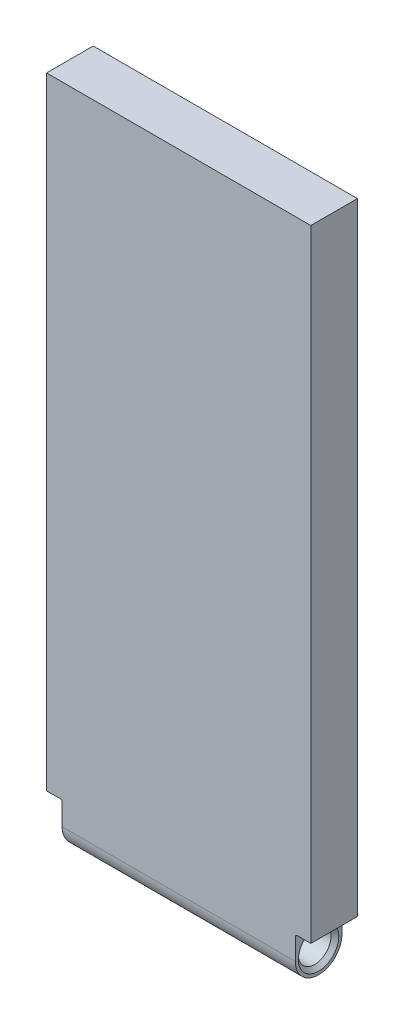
ISO-10303-21;
HEADER;
FILE_DESCRIPTION(('STEP AP214'),'2;1');
FILE_NAME('part.step','',(''),(''),'','','');
FILE_SCHEMA(('AUTOMOTIVE_DESIGN { 1 0 10303 214 1 1 1 1 }'));
ENDSEC;
DATA;
#1=APPLICATION_CONTEXT('core data for automotive mechanical design processes');
#2=APPLICATION_PROTOCOL_DEFINITION('international standard','automotive_design',2000,#1);
#3=PRODUCT_CONTEXT('',#1,'mechanical');
#4=PRODUCT('Part','Part','',(#3));
#5=PRODUCT_RELATED_PRODUCT_CATEGORY('part','',(#4));
#6=PRODUCT_DEFINITION_FORMATION('','',#4);
#7=PRODUCT_DEFINITION_CONTEXT('part definition',#1,'design');
#8=PRODUCT_DEFINITION('design','',#6,#7);
#9=PRODUCT_DEFINITION_SHAPE('','',#8);
#10=(LENGTH_UNIT() NAMED_UNIT(*) SI_UNIT(.MILLI.,.METRE.));
#11=(NAMED_UNIT(*) PLANE_ANGLE_UNIT() SI_UNIT($,.RADIAN.));
#12=(NAMED_UNIT(*) SI_UNIT($,.STERADIAN.) SOLID_ANGLE_UNIT());
#13=UNCERTAINTY_MEASURE_WITH_UNIT(LENGTH_MEASURE(1.E-05),#10,'distance_accuracy_value','');
#14=(GEOMETRIC_REPRESENTATION_CONTEXT(3) GLOBAL_UNCERTAINTY_ASSIGNED_CONTEXT((#13)) GLOBAL_UNIT_ASSIGNED_CONTEXT((#10,
#11,#12)) REPRESENTATION_CONTEXT('',''));
#15=CARTESIAN_POINT('',(0.,0.,0.));
#16=DIRECTION('',(0.,0.,1.));
#17=DIRECTION('',(1.,0.,0.));
#18=AXIS2_PLACEMENT_3D('',#15,#16,#17);
#19=CARTESIAN_POINT('',(-17.,80.,-7.));
#20=DIRECTION('',(0.,1.,0.));
#21=DIRECTION('',(-1.,0.,0.));
#22=AXIS2_PLACEMENT_3D('',#19,#20,#21);
#23=PLANE('',#22);
#24=DIRECTION('',(1.,0.,0.));
#25=VECTOR('',#24,1.);
#26=CARTESIAN_POINT('',(17.,80.,-6.));
#27=LINE('',#26,#25);
#28=CARTESIAN_POINT('',(-17.,80.,-6.));
#29=VERTEX_POINT('',#28);
#30=CARTESIAN_POINT('',(17.,80.,-6.));
#31=VERTEX_POINT('',#30);
#32=EDGE_CURVE('E154',#29,#31,#27,.T.);
#33=ORIENTED_EDGE('',*,*,#32,.F.);
#34=DIRECTION('',(0.,0.,1.));
#35=VECTOR('',#34,1.);
#36=CARTESIAN_POINT('',(-17.,80.,-7.));
#37=LINE('',#36,#35);
#38=CARTESIAN_POINT('',(-17.,80.,0.));
#39=VERTEX_POINT('',#38);
#40=EDGE_CURVE('E187',#29,#39,#37,.T.);
#41=ORIENTED_EDGE('',*,*,#40,.T.);
#42=DIRECTION('',(-1.,0.,0.));
#43=VECTOR('',#42,1.);
#44=CARTESIAN_POINT('',(-17.,80.,0.));
#45=LINE('',#44,#43);
#46=CARTESIAN_POINT('',(17.,80.,0.));
#47=VERTEX_POINT('',#46);
#48=EDGE_CURVE('E200',#47,#39,#45,.T.);
#49=ORIENTED_EDGE('',*,*,#48,.F.);
#50=DIRECTION('',(0.,0.,1.));
#51=VECTOR('',#50,1.);
#52=CARTESIAN_POINT('',(17.,80.,-7.));
#53=LINE('',#52,#51);
#54=EDGE_CURVE('E192',#31,#47,#53,.T.);
#55=ORIENTED_EDGE('',*,*,#54,.F.);
#56=EDGE_LOOP('',(#33,#41,#49,#55));
#57=FACE_BOUND('',#56,.T.);
#58=ADVANCED_FACE('F35',(#57),#23,.T.);
#59=CARTESIAN_POINT('',(-17.,0.,-7.));
#60=DIRECTION('',(0.,-1.,0.));
#61=DIRECTION('',(1.,0.,0.));
#62=AXIS2_PLACEMENT_3D('',#59,#60,#61);
#63=PLANE('',#62);
#64=DIRECTION('',(-1.,0.,0.));
#65=VECTOR('',#64,1.);
#66=CARTESIAN_POINT('',(-15.,0.,-6.));
#67=LINE('',#66,#65);
#68=CARTESIAN_POINT('',(-15.25,0.,-6.));
#69=VERTEX_POINT('',#68);
#70=CARTESIAN_POINT('',(-17.,0.,-6.));
#71=VERTEX_POINT('',#70);
#72=EDGE_CURVE('E131',#69,#71,#67,.T.);
#73=ORIENTED_EDGE('',*,*,#72,.F.);
#74=DIRECTION('',(0.,0.,1.));
#75=VECTOR('',#74,1.);
#76=CARTESIAN_POINT('',(-15.25,0.,-7.));
#77=LINE('',#76,#75);
#78=CARTESIAN_POINT('',(-15.25,0.,0.));
#79=VERTEX_POINT('',#78);
#80=EDGE_CURVE('E182',#69,#79,#77,.T.);
#81=ORIENTED_EDGE('',*,*,#80,.T.);
#82=DIRECTION('',(1.,0.,0.));
#83=VECTOR('',#82,1.);
#84=CARTESIAN_POINT('',(-17.,0.,0.));
#85=LINE('',#84,#83);
#86=CARTESIAN_POINT('',(-17.,0.,0.));
#87=VERTEX_POINT('',#86);
#88=EDGE_CURVE('E168',#87,#79,#85,.T.);
#89=ORIENTED_EDGE('',*,*,#88,.F.);
#90=DIRECTION('',(0.,0.,1.));
#91=VECTOR('',#90,1.);
#92=CARTESIAN_POINT('',(-17.,0.,-7.));
#93=LINE('',#92,#91);
#94=EDGE_CURVE('E172',#71,#87,#93,.T.);
#95=ORIENTED_EDGE('',*,*,#94,.F.);
#96=EDGE_LOOP('',(#73,#81,#89,#95));
#97=FACE_BOUND('',#96,.T.);
#98=ADVANCED_FACE('F220',(#97),#63,.T.);
#99=CARTESIAN_POINT('',(17.,80.,-7.));
#100=DIRECTION('',(1.,0.,0.));
#101=DIRECTION('',(0.,1.,0.));
#102=AXIS2_PLACEMENT_3D('',#99,#100,#101);
#103=PLANE('',#102);
#104=DIRECTION('',(0.,0.,1.));
#105=VECTOR('',#104,1.);
#106=CARTESIAN_POINT('',(17.,0.,-7.));
#107=LINE('',#106,#105);
#108=CARTESIAN_POINT('',(17.,0.,-6.));
#109=VERTEX_POINT('',#108);
#110=CARTESIAN_POINT('',(17.,0.,0.));
#111=VERTEX_POINT('',#110);
#112=EDGE_CURVE('E198',#109,#111,#107,.T.);
#113=ORIENTED_EDGE('',*,*,#112,.F.);
#114=DIRECTION('',(0.,-1.,0.));
#115=VECTOR('',#114,1.);
#116=CARTESIAN_POINT('',(17.,80.,-6.));
#117=LINE('',#116,#115);
#118=EDGE_CURVE('E150',#31,#109,#117,.T.);
#119=ORIENTED_EDGE('',*,*,#118,.F.);
#120=ORIENTED_EDGE('',*,*,#54,.T.);
#121=DIRECTION('',(0.,1.,0.));
#122=VECTOR('',#121,1.);
#123=CARTESIAN_POINT('',(17.,80.,0.));
#124=LINE('',#123,#122);
#125=EDGE_CURVE('E161',#111,#47,#124,.T.);
#126=ORIENTED_EDGE('',*,*,#125,.F.);
#127=EDGE_LOOP('',(#113,#119,#120,#126));
#128=FACE_BOUND('',#127,.T.);
#129=ADVANCED_FACE('F212',(#128),#103,.T.);
#130=CARTESIAN_POINT('',(-17.,80.,-7.));
#131=DIRECTION('',(-1.,0.,0.));
#132=DIRECTION('',(0.,-1.,0.));
#133=AXIS2_PLACEMENT_3D('',#130,#131,#132);
#134=PLANE('',#133);
#135=DIRECTION('',(0.,1.,0.));
#136=VECTOR('',#135,1.);
#137=CARTESIAN_POINT('',(-17.,80.,-6.));
#138=LINE('',#137,#136);
#139=EDGE_CURVE('E147',#71,#29,#138,.T.);
#140=ORIENTED_EDGE('',*,*,#139,.F.);
#141=ORIENTED_EDGE('',*,*,#94,.T.);
#142=DIRECTION('',(0.,-1.,0.));
#143=VECTOR('',#142,1.);
#144=CARTESIAN_POINT('',(-17.,80.,0.));
#145=LINE('',#144,#143);
#146=EDGE_CURVE('E156',#39,#87,#145,.T.);
#147=ORIENTED_EDGE('',*,*,#146,.F.);
#148=ORIENTED_EDGE('',*,*,#40,.F.);
#149=EDGE_LOOP('',(#140,#141,#147,#148));
#150=FACE_BOUND('',#149,.T.);
#151=ADVANCED_FACE('F218',(#150),#134,.T.);
#152=CARTESIAN_POINT('',(15.25,0.,0.));
#153=VERTEX_POINT('',#152);
#154=EDGE_CURVE('E158',#153,#111,#85,.T.);
#155=ORIENTED_EDGE('',*,*,#154,.F.);
#156=DIRECTION('',(0.,0.,1.));
#157=VECTOR('',#156,1.);
#158=CARTESIAN_POINT('',(15.25,0.,-6.));
#159=LINE('',#158,#157);
#160=CARTESIAN_POINT('',(15.25,0.,-6.));
#161=VERTEX_POINT('',#160);
#162=EDGE_CURVE('E57',#153,#161,#159,.F.);
#163=ORIENTED_EDGE('',*,*,#162,.T.);
#164=DIRECTION('',(-1.,0.,0.));
#165=VECTOR('',#164,1.);
#166=CARTESIAN_POINT('',(17.,0.,-6.));
#167=LINE('',#166,#165);
#168=EDGE_CURVE('E152',#109,#161,#167,.T.);
#169=ORIENTED_EDGE('',*,*,#168,.F.);
#170=ORIENTED_EDGE('',*,*,#112,.T.);
#171=EDGE_LOOP('',(#155,#163,#169,#170));
#172=FACE_BOUND('',#171,.T.);
#173=ADVANCED_FACE('F216',(#172),#63,.T.);
#174=CARTESIAN_POINT('',(0.,0.,0.));
#175=DIRECTION('',(0.,0.,1.));
#176=DIRECTION('',(1.,0.,0.));
#177=AXIS2_PLACEMENT_3D('',#174,#175,#176);
#178=PLANE('',#177);
#179=ORIENTED_EDGE('',*,*,#146,.T.);
#180=ORIENTED_EDGE('',*,*,#88,.T.);
#181=CARTESIAN_POINT('',(-15.25,-0.250000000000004,0.));
#182=DIRECTION('',(0.,0.,1.));
#183=DIRECTION('',(1.,0.,0.));
#184=AXIS2_PLACEMENT_3D('',#181,#182,#183);
#185=CIRCLE('',#184,0.25);
#186=CARTESIAN_POINT('',(-15.,-0.250000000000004,0.));
#187=VERTEX_POINT('',#186);
#188=EDGE_CURVE('E181',#79,#187,#185,.F.);
#189=ORIENTED_EDGE('',*,*,#188,.T.);
#190=DIRECTION('',(0.,-1.,0.));
#191=VECTOR('',#190,1.);
#192=CARTESIAN_POINT('',(-15.,0.,0.));
#193=LINE('',#192,#191);
#194=CARTESIAN_POINT('',(-15.,-3.,0.));
#195=VERTEX_POINT('',#194);
#196=EDGE_CURVE('E128',#187,#195,#193,.T.);
#197=ORIENTED_EDGE('',*,*,#196,.T.);
#198=DIRECTION('',(-1.,0.,0.));
#199=VECTOR('',#198,1.);
#200=CARTESIAN_POINT('',(15.,-3.,0.));
#201=LINE('',#200,#199);
#202=CARTESIAN_POINT('',(15.,-3.,0.));
#203=VERTEX_POINT('',#202);
#204=EDGE_CURVE('E124',#203,#195,#201,.T.);
#205=ORIENTED_EDGE('',*,*,#204,.F.);
#206=DIRECTION('',(0.,-1.,0.));
#207=VECTOR('',#206,1.);
#208=CARTESIAN_POINT('',(15.,0.,0.));
#209=LINE('',#208,#207);
#210=CARTESIAN_POINT('',(15.,-0.25,0.));
#211=VERTEX_POINT('',#210);
#212=EDGE_CURVE('E112',#211,#203,#209,.T.);
#213=ORIENTED_EDGE('',*,*,#212,.F.);
#214=CARTESIAN_POINT('',(15.25,-0.25,0.));
#215=DIRECTION('',(0.,0.,1.));
#216=DIRECTION('',(1.,0.,0.));
#217=AXIS2_PLACEMENT_3D('',#214,#215,#216);
#218=CIRCLE('',#217,0.25);
#219=EDGE_CURVE('E50',#211,#153,#218,.F.);
#220=ORIENTED_EDGE('',*,*,#219,.T.);
#221=ORIENTED_EDGE('',*,*,#154,.T.);
#222=ORIENTED_EDGE('',*,*,#125,.T.);
#223=ORIENTED_EDGE('',*,*,#48,.T.);
#224=EDGE_LOOP('',(#179,#180,#189,#197,#205,#213,#220,#221,#222,#223));
#225=FACE_BOUND('',#224,.T.);
#226=ADVANCED_FACE('F126',(#225),#178,.T.);
#227=CARTESIAN_POINT('',(0.,0.,-6.));
#228=DIRECTION('',(0.,0.,-1.));
#229=DIRECTION('',(-1.,0.,0.));
#230=AXIS2_PLACEMENT_3D('',#227,#228,#229);
#231=PLANE('',#230);
#232=ORIENTED_EDGE('',*,*,#118,.T.);
#233=ORIENTED_EDGE('',*,*,#168,.T.);
#234=CARTESIAN_POINT('',(15.25,-0.25,-6.));
#235=DIRECTION('',(0.,0.,-1.));
#236=DIRECTION('',(-1.,0.,0.));
#237=AXIS2_PLACEMENT_3D('',#234,#235,#236);
#238=CIRCLE('',#237,0.25);
#239=CARTESIAN_POINT('',(15.,-0.25,-6.));
#240=VERTEX_POINT('',#239);
#241=EDGE_CURVE('E360',#161,#240,#238,.F.);
#242=ORIENTED_EDGE('',*,*,#241,.T.);
#243=DIRECTION('',(0.,1.,0.));
#244=VECTOR('',#243,1.);
#245=CARTESIAN_POINT('',(15.,0.,-6.));
#246=LINE('',#245,#244);
#247=CARTESIAN_POINT('',(15.,-3.,-6.));
#248=VERTEX_POINT('',#247);
#249=EDGE_CURVE('E137',#248,#240,#246,.T.);
#250=ORIENTED_EDGE('',*,*,#249,.F.);
#251=DIRECTION('',(-1.,0.,0.));
#252=VECTOR('',#251,1.);
#253=CARTESIAN_POINT('',(15.,-3.,-6.));
#254=LINE('',#253,#252);
#255=CARTESIAN_POINT('',(-15.,-3.,-6.));
#256=VERTEX_POINT('',#255);
#257=EDGE_CURVE('E132',#248,#256,#254,.T.);
#258=ORIENTED_EDGE('',*,*,#257,.T.);
#259=DIRECTION('',(0.,1.,0.));
#260=VECTOR('',#259,1.);
#261=CARTESIAN_POINT('',(-15.,0.,-6.));
#262=LINE('',#261,#260);
#263=CARTESIAN_POINT('',(-15.,-0.250000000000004,-6.));
#264=VERTEX_POINT('',#263);
#265=EDGE_CURVE('E121',#256,#264,#262,.T.);
#266=ORIENTED_EDGE('',*,*,#265,.T.);
#267=CARTESIAN_POINT('',(-15.25,-0.250000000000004,-6.));
#268=DIRECTION('',(0.,0.,-1.));
#269=DIRECTION('',(-1.,0.,0.));
#270=AXIS2_PLACEMENT_3D('',#267,#268,#269);
#271=CIRCLE('',#270,0.25);
#272=EDGE_CURVE('E365',#264,#69,#271,.F.);
#273=ORIENTED_EDGE('',*,*,#272,.T.);
#274=ORIENTED_EDGE('',*,*,#72,.T.);
#275=ORIENTED_EDGE('',*,*,#139,.T.);
#276=ORIENTED_EDGE('',*,*,#32,.T.);
#277=EDGE_LOOP('',(#232,#233,#242,#250,#258,#266,#273,#274,#275,#276));
#278=FACE_BOUND('',#277,.T.);
#279=ADVANCED_FACE('F214',(#278),#231,.T.);
#280=CARTESIAN_POINT('',(15.,-3.,-3.));
#281=DIRECTION('',(1.,0.,0.));
#282=DIRECTION('',(0.,0.,-1.));
#283=AXIS2_PLACEMENT_3D('',#280,#281,#282);
#284=PLANE('',#283);
#285=CARTESIAN_POINT('',(15.,-3.,-3.));
#286=DIRECTION('',(1.,0.,0.));
#287=DIRECTION('',(0.,0.,-1.));
#288=AXIS2_PLACEMENT_3D('',#285,#286,#287);
#289=CIRCLE('',#288,2.6);
#290=CARTESIAN_POINT('',(15.,-3.,-5.6));
#291=VERTEX_POINT('',#290);
#292=EDGE_CURVE('E11',#291,#291,#289,.F.);
#293=ORIENTED_EDGE('',*,*,#292,.T.);
#294=EDGE_LOOP('',(#293));
#295=FACE_BOUND('',#294,.T.);
#296=ORIENTED_EDGE('',*,*,#249,.T.);
#297=DIRECTION('',(0.,0.,1.));
#298=VECTOR('',#297,1.);
#299=CARTESIAN_POINT('',(15.,-0.25,0.));
#300=LINE('',#299,#298);
#301=EDGE_CURVE('E120',#240,#211,#300,.T.);
#302=ORIENTED_EDGE('',*,*,#301,.T.);
#303=ORIENTED_EDGE('',*,*,#212,.T.);
#304=CARTESIAN_POINT('',(15.,-3.,-3.));
#305=DIRECTION('',(1.,0.,0.));
#306=DIRECTION('',(0.,0.,-1.));
#307=AXIS2_PLACEMENT_3D('',#304,#305,#306);
#308=CIRCLE('',#307,3.);
#309=EDGE_CURVE('E117',#203,#248,#308,.T.);
#310=ORIENTED_EDGE('',*,*,#309,.T.);
#311=EDGE_LOOP('',(#296,#302,#303,#310));
#312=FACE_BOUND('',#311,.T.);
#313=ADVANCED_FACE('F115',(#295,#312),#284,.T.);
#314=CARTESIAN_POINT('',(-15.,-3.,-3.));
#315=DIRECTION('',(1.,0.,0.));
#316=DIRECTION('',(0.,0.,-1.));
#317=AXIS2_PLACEMENT_3D('',#314,#315,#316);
#318=PLANE('',#317);
#319=CARTESIAN_POINT('',(-15.,-3.,-3.));
#320=DIRECTION('',(1.,0.,0.));
#321=DIRECTION('',(0.,0.,-1.));
#322=AXIS2_PLACEMENT_3D('',#319,#320,#321);
#323=CIRCLE('',#322,2.59999999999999);
#324=CARTESIAN_POINT('',(-15.,-3.,-5.59999999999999));
#325=VERTEX_POINT('',#324);
#326=EDGE_CURVE('E356',#325,#325,#323,.T.);
#327=ORIENTED_EDGE('',*,*,#326,.T.);
#328=EDGE_LOOP('',(#327));
#329=FACE_BOUND('',#328,.T.);
#330=ORIENTED_EDGE('',*,*,#196,.F.);
#331=DIRECTION('',(0.,0.,1.));
#332=VECTOR('',#331,1.);
#333=CARTESIAN_POINT('',(-15.,-0.250000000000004,-3.));
#334=LINE('',#333,#332);
#335=EDGE_CURVE('E179',#187,#264,#334,.F.);
#336=ORIENTED_EDGE('',*,*,#335,.T.);
#337=ORIENTED_EDGE('',*,*,#265,.F.);
#338=CARTESIAN_POINT('',(-15.,-3.,-3.));
#339=DIRECTION('',(1.,0.,0.));
#340=DIRECTION('',(0.,0.,-1.));
#341=AXIS2_PLACEMENT_3D('',#338,#339,#340);
#342=CIRCLE('',#341,3.);
#343=EDGE_CURVE('E141',#195,#256,#342,.T.);
#344=ORIENTED_EDGE('',*,*,#343,.F.);
#345=EDGE_LOOP('',(#330,#336,#337,#344));
#346=FACE_BOUND('',#345,.T.);
#347=ADVANCED_FACE('F253',(#329,#346),#318,.F.);
#348=CARTESIAN_POINT('',(15.,-3.,-3.));
#349=DIRECTION('',(-1.,0.,0.));
#350=DIRECTION('',(0.,0.,1.));
#351=AXIS2_PLACEMENT_3D('',#348,#349,#350);
#352=CYLINDRICAL_SURFACE('',#351,3.);
#353=ORIENTED_EDGE('',*,*,#343,.T.);
#354=ORIENTED_EDGE('',*,*,#257,.F.);
#355=ORIENTED_EDGE('',*,*,#309,.F.);
#356=ORIENTED_EDGE('',*,*,#204,.T.);
#357=EDGE_LOOP('',(#353,#354,#355,#356));
#358=FACE_BOUND('',#357,.T.);
#359=ADVANCED_FACE('F134',(#358),#352,.T.);
#360=CARTESIAN_POINT('',(15.,-3.,-3.));
#361=DIRECTION('',(-1.,0.,0.));
#362=DIRECTION('',(0.,0.,1.));
#363=AXIS2_PLACEMENT_3D('',#360,#361,#362);
#364=CYLINDRICAL_SURFACE('',#363,2.1);
#365=CARTESIAN_POINT('',(-14.5,-3.,-3.));
#366=DIRECTION('',(1.,0.,0.));
#367=DIRECTION('',(0.,0.,-1.));
#368=AXIS2_PLACEMENT_3D('',#365,#366,#367);
#369=CIRCLE('',#368,2.1);
#370=CARTESIAN_POINT('',(-14.5,-3.,-5.1));
#371=VERTEX_POINT('',#370);
#372=EDGE_CURVE('E43',#371,#371,#369,.F.);
#373=ORIENTED_EDGE('',*,*,#372,.T.);
#374=EDGE_LOOP('',(#373));
#375=FACE_BOUND('',#374,.T.);
#376=CARTESIAN_POINT('',(14.5,-3.,-3.));
#377=DIRECTION('',(1.,0.,0.));
#378=DIRECTION('',(0.,0.,-1.));
#379=AXIS2_PLACEMENT_3D('',#376,#377,#378);
#380=CIRCLE('',#379,2.1);
#381=CARTESIAN_POINT('',(14.5,-3.,-5.1));
#382=VERTEX_POINT('',#381);
#383=EDGE_CURVE('E354',#382,#382,#380,.T.);
#384=ORIENTED_EDGE('',*,*,#383,.T.);
#385=EDGE_LOOP('',(#384));
#386=FACE_BOUND('',#385,.T.);
#387=ADVANCED_FACE('F252',(#375,#386),#364,.F.);
#388=CARTESIAN_POINT('',(-15.25,-0.250000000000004,-7.));
#389=DIRECTION('',(0.,0.,1.));
#390=DIRECTION('',(1.,0.,0.));
#391=AXIS2_PLACEMENT_3D('',#388,#389,#390);
#392=CYLINDRICAL_SURFACE('',#391,0.25);
#393=ORIENTED_EDGE('',*,*,#272,.F.);
#394=ORIENTED_EDGE('',*,*,#335,.F.);
#395=ORIENTED_EDGE('',*,*,#188,.F.);
#396=ORIENTED_EDGE('',*,*,#80,.F.);
#397=EDGE_LOOP('',(#393,#394,#395,#396));
#398=FACE_BOUND('',#397,.T.);
#399=ADVANCED_FACE('F294',(#398),#392,.F.);
#400=CARTESIAN_POINT('',(15.25,-0.25,-3.));
#401=DIRECTION('',(0.,0.,-1.));
#402=DIRECTION('',(-1.,0.,0.));
#403=AXIS2_PLACEMENT_3D('',#400,#401,#402);
#404=CYLINDRICAL_SURFACE('',#403,0.25);
#405=ORIENTED_EDGE('',*,*,#241,.F.);
#406=ORIENTED_EDGE('',*,*,#162,.F.);
#407=ORIENTED_EDGE('',*,*,#219,.F.);
#408=ORIENTED_EDGE('',*,*,#301,.F.);
#409=EDGE_LOOP('',(#405,#406,#407,#408));
#410=FACE_BOUND('',#409,.T.);
#411=ADVANCED_FACE('F298',(#410),#404,.F.);
#412=CARTESIAN_POINT('',(-15.,-3.,-3.));
#413=DIRECTION('',(-1.,0.,0.));
#414=DIRECTION('',(0.,0.,1.));
#415=AXIS2_PLACEMENT_3D('',#412,#413,#414);
#416=CONICAL_SURFACE('',#415,2.59999999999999,0.785398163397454);
#417=ORIENTED_EDGE('',*,*,#372,.F.);
#418=EDGE_LOOP('',(#417));
#419=FACE_BOUND('',#418,.T.);
#420=ORIENTED_EDGE('',*,*,#326,.F.);
#421=EDGE_LOOP('',(#420));
#422=FACE_BOUND('',#421,.T.);
#423=ADVANCED_FACE('F308',(#419,#422),#416,.F.);
#424=CARTESIAN_POINT('',(14.5,-3.,-3.));
#425=DIRECTION('',(1.,0.,0.));
#426=DIRECTION('',(0.,0.,-1.));
#427=AXIS2_PLACEMENT_3D('',#424,#425,#426);
#428=CONICAL_SURFACE('',#427,2.1,0.785398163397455);
#429=ORIENTED_EDGE('',*,*,#292,.F.);
#430=EDGE_LOOP('',(#429));
#431=FACE_BOUND('',#430,.T.);
#432=ORIENTED_EDGE('',*,*,#383,.F.);
#433=EDGE_LOOP('',(#432));
#434=FACE_BOUND('',#433,.T.);
#435=ADVANCED_FACE('F37',(#431,#434),#428,.F.);
#436=CLOSED_SHELL('',(#58,#98,#129,#151,#173,#226,#279,#313,#347,#359,#387,#399,#411,#423,#435));
#437=MANIFOLD_SOLID_BREP('B2',#436);
#438=ADVANCED_BREP_SHAPE_REPRESENTATION('',(#18,#437),#14);
#439=SHAPE_DEFINITION_REPRESENTATION(#9,#438);
ENDSEC;
END-ISO-10303-21;
